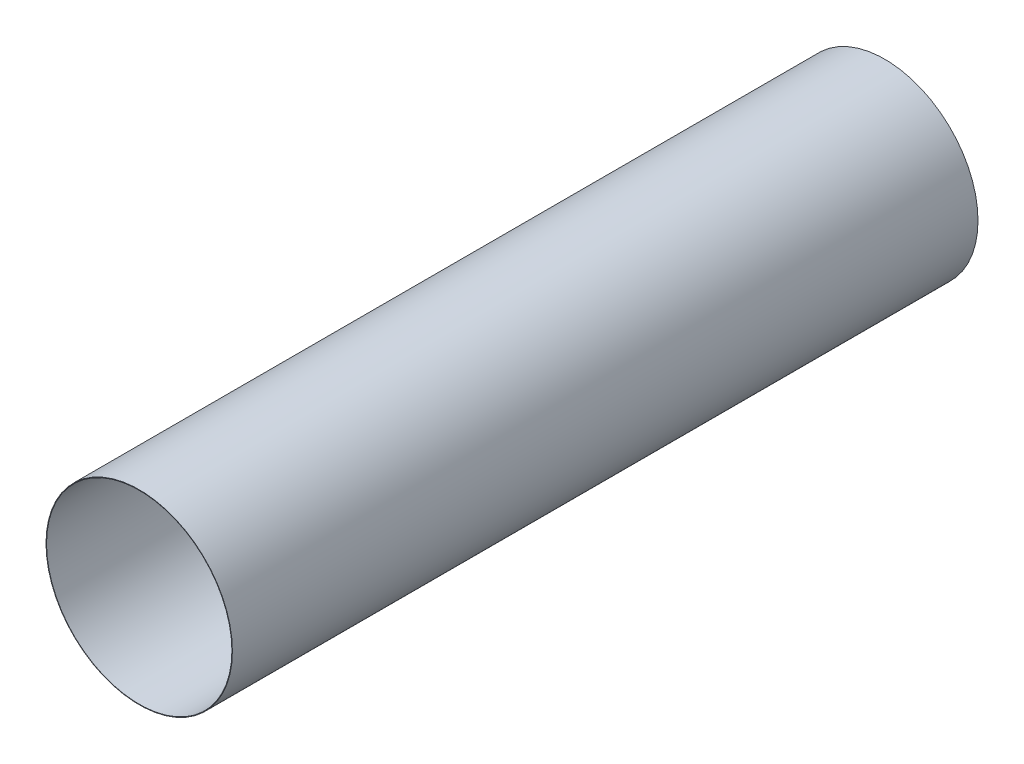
from build123d import *

# Parameters (mm, degrees)
DUCTSKETCH_R    = 375
DUCTSKETCH_R_2  = 373
EXTRUSION_DEPTH = 3000


with BuildPart() as part:
    # DuctSketch → Extrusion (new body)
    with BuildSketch(Plane.XY):
        Circle(DUCTSKETCH_R)
        Circle(DUCTSKETCH_R_2, mode=Mode.SUBTRACT)
    extrude(amount=EXTRUSION_DEPTH)


solid = part.part
